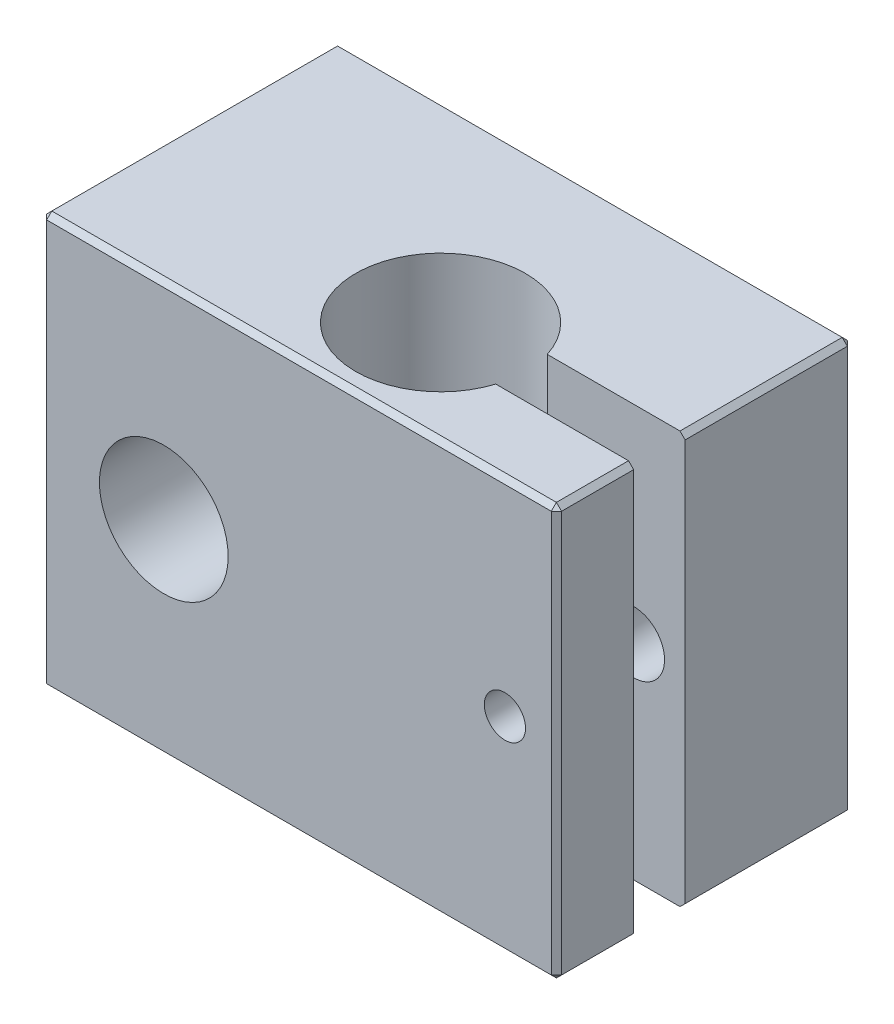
from build123d import *

# Parameters (mm, degrees)
ESQUISSE1_W             = 20
ESQUISSE1_H             = 16
BOSS_EXTRU_1_DEPTH      = 11.5
TROU_TARAUD_M61_D       = 5
PER_AGE1_D              = 1
PER_AGE1_DEPTH          = 4.5
PER_AGE1_CBORE_D        = 2
PER_AGE1_CBORE_DEPTH    = 2
TROU_TARAUD_M2_51_D     = 2.05
TROU_TARAUD_M2_51_DEPTH = 4.5
TROU_TARAUD_M2_51_TIP   = 0.615882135
D_GAGEMENT_M61_D        = 6.6
ESQUISSE10_W            = 11.487199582
ESQUISSE10_H            = 2
ENL_V_MAT_EXTRU_1_DEPTH = 25.916109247
TROU_TARAUD_M21_D       = 1.6
TROU_TARAUD_M21_DEPTH   = 3
D_GAGEMENT_M21_D        = 2.4
D_GAGEMENT_M21_DEPTH    = 6.5
CHANFREIN1_SIZE         = 0.2


with BuildPart() as part:
    # Esquisse1 → Boss.-Extru.1 (new body)
    with BuildSketch(Plane.XY):
        with Locations((5.25, 0)):
            Rectangle(ESQUISSE1_W, ESQUISSE1_H)
    extrude(amount=BOSS_EXTRU_1_DEPTH)

    # Trou taraud_ M61 (through all)
    with Locations(Plane.XY.offset(11.5)):
        with Locations((0, 0)):
            Hole(TROU_TARAUD_M61_D / 2)

    # Per_age1
    with Locations(Plane(origin=(0, -8, 0), x_dir=(-1, 0, 0), z_dir=(0, -1, 0))):
        with Locations((2.25, -9)):
            CounterBoreHole(PER_AGE1_D / 2, PER_AGE1_CBORE_D / 2, PER_AGE1_CBORE_DEPTH, depth=PER_AGE1_DEPTH)

    # Trou taraud_ M2.51
    with Locations(Plane(origin=(0, -8, 0), x_dir=(-1, 0, 0), z_dir=(0, -1, 0))):
        with Locations((1.25, -6.5)):
            Hole(TROU_TARAUD_M2_51_D / 2, depth=TROU_TARAUD_M2_51_DEPTH)
            with Locations((0, 0, -(TROU_TARAUD_M2_51_DEPTH + TROU_TARAUD_M2_51_TIP / 2))):  # 118° drill point
                Cone(0, TROU_TARAUD_M2_51_D / 2, TROU_TARAUD_M2_51_TIP, mode=Mode.SUBTRACT)

    # D_gagement M61 (through all)
    with Locations(Plane(origin=(0, -8, 0), x_dir=(-1, 0, 0), z_dir=(0, -1, 0))):
        with Locations((-6.75, -7.5)):
            Hole(D_GAGEMENT_M61_D / 2)

    # Esquisse10 → Enl_v. mat.-Extru.1 (cut, through all)
    with BuildSketch(Plane.XZ.offset(8)):
        with Locations((12.493599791, 7.5)):
            Rectangle(ESQUISSE10_W, ESQUISSE10_H)
    extrude(amount=-ENL_V_MAT_EXTRU_1_DEPTH, mode=Mode.SUBTRACT)

    # Trou taraud_ M21
    with Locations(Plane.XY.offset(11.5)):
        with Locations((13.25, 0)):
            Hole(TROU_TARAUD_M21_D / 2, depth=TROU_TARAUD_M21_DEPTH)

    # D_gagement M21
    with Locations(Plane(origin=(0, 0, 0), x_dir=(-1, 0, 0), z_dir=(0, 0, -1))):
        with Locations((-13.25, 0)):
            Hole(D_GAGEMENT_M21_D / 2, depth=D_GAGEMENT_M21_DEPTH)

    # Chanfrein1
    chanfrein1_edges = [part.edges().sort_by_distance(p)[0] for p in [
        (15.25, 0, 11.5),
        (5.25, 8, 11.5),
        (15.25, 8, 3.25),
        (15.25, -8, 3.25),
        (-4.75, 0, 11.5),
        (5.25, 8, 0),
        (15.25, 0, 0),
        (5.25, -8, 0),
        (-4.75, 0, 0),
        (5.25, -8, 11.5),
        (-4.75, 8, 5.75),
        (15.25, 8, 10),
        (15.25, -8, 10),
        (-4.75, -8, 5.75),
    ]]
    chamfer(chanfrein1_edges, length=CHANFREIN1_SIZE)


solid = part.part
